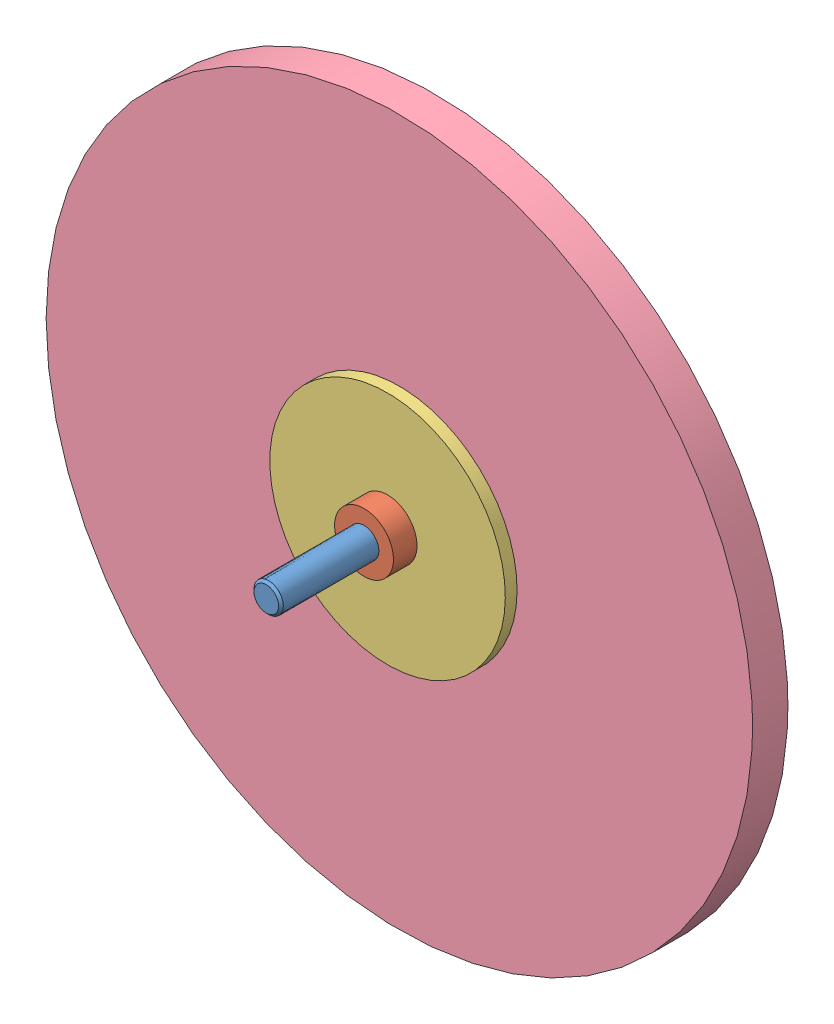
SolidWorks assembly 放料盘1.SLDASM, configuration 默认 (file format 8000). Lengths in mm.
Overall size (600 600 180).
6 component instances, 4 part files, 12 mates.
Components (placement in the parent):
- usb 0.001-1: usb 0.001.SLDPRT [默认] at (-7.0467 5.2659 -90) size (25 25 180)
- usb 0.002-1: usb 0.002.SLDPRT [默认] at (-7.0467 5.2659 -83) size (50 50 20)
- usb 0.002-2: usb 0.002.SLDPRT [默认] at (-7.0467 5.2659 7) x (-0.967322 -0.253551 0) z (0 0 -1) size (50 50 20)
- usb 0.003-1: usb 0.003.SLDPRT [默认] at (-7.0467 5.2659 -63) size (200 200 10)
- usb 0.003-2: usb 0.003.SLDPRT [默认] at (-7.0467 5.2659 -13) x (-0.253551 0.967322 0) z (0 0 -1) size (200 200 10)
- usb 0.004-1: usb 0.004.SLDPRT [默认] at (-7.0467 5.2659 -53) size (600 600 30)
Mates (geometry in assembly coordinates):
- 同心1: concentric aligned: cylinder of usb 0.001-1 through (-7.0467 5.2659 90) axis (0 0 -1) radius 12.5; cylinder of usb 0.002-1 through (-7.0467 5.2659 -63) axis (0 0 -1) radius 12.6
- 距离1: distance = 7 mm aligned: plane of usb 0.002-1 through (-7.0467 5.2659 -83) normal (0 0 -1); plane of usb 0.001-1 through (-7.0467 5.2659 -90) normal (0 0 -1)
- 同心2: concentric anti-aligned: cylinder of usb 0.001-1 through (-7.0467 5.2659 90) axis (0 0 -1) radius 12.5; cylinder of usb 0.002-2 through (-7.0467 5.2659 -13) axis (0 0 1) radius 12.6
- 距离2: distance = 50 mm anti-aligned: plane of usb 0.002-2 through (-7.0467 5.2659 -13) normal (0 0 -1); plane of usb 0.002-1 through (-7.0467 5.2659 -63) normal (0 0 1)
- 同心3: concentric aligned: cylinder of usb 0.001-1 through (-7.0467 5.2659 90) axis (0 0 -1) radius 12.5; cylinder of usb 0.003-1 through (-7.0467 5.2659 -53) axis (0 0 -1) radius 12.75
- 同心4: concentric aligned: cylinder of usb 0.002-1 through (12.9533 5.2659 -78) axis (0 0 1) radius 1.65; cylinder of usb 0.003-1 through (12.9533 5.2659 -57.5) axis (0 0 1) radius 4
- 重合3: coincident anti-aligned: plane of usb 0.002-1 through (-7.0467 5.2659 -63) normal (0 0 1); plane of usb 0.003-1 through (-7.0467 5.2659 -63) normal (0 0 -1)
- 同心5: concentric anti-aligned: cylinder of usb 0.001-1 through (-7.0467 5.2659 90) axis (0 0 -1) radius 12.5; cylinder of usb 0.003-2 through (-7.0467 5.2659 -23) axis (0 0 1) radius 12.75
- 同心6: concentric aligned: circle of usb 0.002-2; circle of usb 0.003-2
- 重合4: coincident anti-aligned: plane of usb 0.002-2 through (-7.0467 5.2659 -13) normal (0 0 -1); plane of usb 0.003-2 through (-7.0467 5.2659 -13) normal (0 0 1)
- 同心7: concentric anti-aligned: cylinder of usb 0.002-2 through (-7.0467 5.2659 -13) axis (0 0 1) radius 25; cylinder of usb 0.004-1 through (-7.0467 5.2659 -23) axis (0 0 -1) radius 300
- 重合5: coincident anti-aligned: plane of usb 0.003-2 through (-7.0467 5.2659 -23) normal (0 0 -1); plane of usb 0.004-1 through (-7.0467 5.2659 -23) normal (0 0 1)
